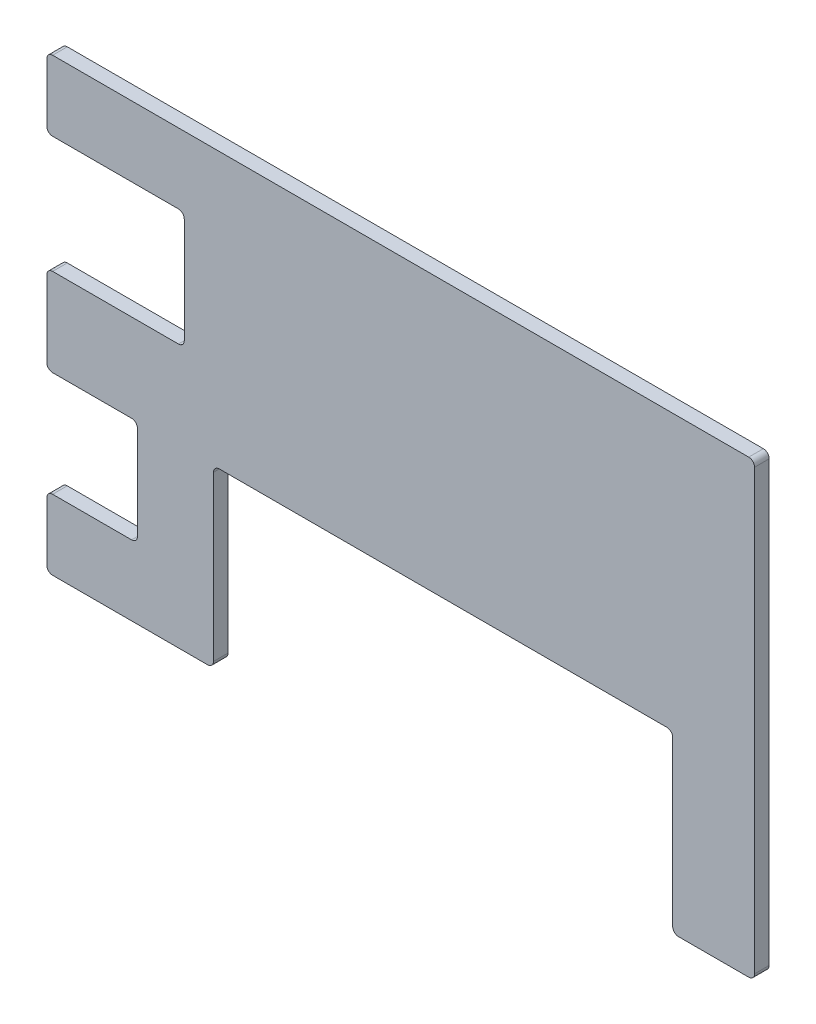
ISO-10303-21;
HEADER;
FILE_DESCRIPTION(('STEP AP214'),'2;1');
FILE_NAME('part.step','',(''),(''),'','','');
FILE_SCHEMA(('AUTOMOTIVE_DESIGN { 1 0 10303 214 1 1 1 1 }'));
ENDSEC;
DATA;
#1=APPLICATION_CONTEXT('core data for automotive mechanical design processes');
#2=APPLICATION_PROTOCOL_DEFINITION('international standard','automotive_design',2000,#1);
#3=PRODUCT_CONTEXT('',#1,'mechanical');
#4=PRODUCT('Part','Part','',(#3));
#5=PRODUCT_RELATED_PRODUCT_CATEGORY('part','',(#4));
#6=PRODUCT_DEFINITION_FORMATION('','',#4);
#7=PRODUCT_DEFINITION_CONTEXT('part definition',#1,'design');
#8=PRODUCT_DEFINITION('design','',#6,#7);
#9=PRODUCT_DEFINITION_SHAPE('','',#8);
#10=(LENGTH_UNIT() NAMED_UNIT(*) SI_UNIT(.MILLI.,.METRE.));
#11=(NAMED_UNIT(*) PLANE_ANGLE_UNIT() SI_UNIT($,.RADIAN.));
#12=(NAMED_UNIT(*) SI_UNIT($,.STERADIAN.) SOLID_ANGLE_UNIT());
#13=UNCERTAINTY_MEASURE_WITH_UNIT(LENGTH_MEASURE(1.E-05),#10,'distance_accuracy_value','');
#14=(GEOMETRIC_REPRESENTATION_CONTEXT(3) GLOBAL_UNCERTAINTY_ASSIGNED_CONTEXT((#13)) GLOBAL_UNIT_ASSIGNED_CONTEXT((#10,
#11,#12)) REPRESENTATION_CONTEXT('',''));
#15=CARTESIAN_POINT('',(0.,0.,0.));
#16=DIRECTION('',(0.,0.,1.));
#17=DIRECTION('',(1.,0.,0.));
#18=AXIS2_PLACEMENT_3D('',#15,#16,#17);
#19=CARTESIAN_POINT('',(59.5000007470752,37.0000007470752,2.5));
#20=DIRECTION('',(0.,0.,-1.));
#21=DIRECTION('',(-1.,0.,0.));
#22=AXIS2_PLACEMENT_3D('',#19,#20,#21);
#23=CYLINDRICAL_SURFACE('',#22,0.999999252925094);
#24=CARTESIAN_POINT('',(59.5000007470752,37.0000007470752,0.));
#25=DIRECTION('',(0.,0.,1.));
#26=DIRECTION('',(1.,0.,0.));
#27=AXIS2_PLACEMENT_3D('',#24,#25,#26);
#28=CIRCLE('',#27,0.999999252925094);
#29=CARTESIAN_POINT('',(60.5,37.,0.));
#30=VERTEX_POINT('',#29);
#31=CARTESIAN_POINT('',(59.5,38.,0.));
#32=VERTEX_POINT('',#31);
#33=EDGE_CURVE('E273',#30,#32,#28,.T.);
#34=ORIENTED_EDGE('',*,*,#33,.T.);
#35=DIRECTION('',(0.,0.,-1.));
#36=VECTOR('',#35,1.);
#37=CARTESIAN_POINT('',(59.5,38.,2.5));
#38=LINE('',#37,#36);
#39=CARTESIAN_POINT('',(59.5,38.,2.5));
#40=VERTEX_POINT('',#39);
#41=EDGE_CURVE('E11',#40,#32,#38,.T.);
#42=ORIENTED_EDGE('',*,*,#41,.F.);
#43=CARTESIAN_POINT('',(59.5000007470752,37.0000007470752,2.5));
#44=DIRECTION('',(0.,0.,1.));
#45=DIRECTION('',(1.,0.,0.));
#46=AXIS2_PLACEMENT_3D('',#43,#44,#45);
#47=CIRCLE('',#46,0.999999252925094);
#48=CARTESIAN_POINT('',(60.5,37.,2.5));
#49=VERTEX_POINT('',#48);
#50=EDGE_CURVE('E347',#49,#40,#47,.T.);
#51=ORIENTED_EDGE('',*,*,#50,.F.);
#52=DIRECTION('',(0.,0.,-1.));
#53=VECTOR('',#52,1.);
#54=CARTESIAN_POINT('',(60.5,37.,2.5));
#55=LINE('',#54,#53);
#56=EDGE_CURVE('E269',#49,#30,#55,.T.);
#57=ORIENTED_EDGE('',*,*,#56,.T.);
#58=EDGE_LOOP('',(#34,#42,#51,#57));
#59=FACE_BOUND('',#58,.T.);
#60=ADVANCED_FACE('F33',(#59),#23,.T.);
#61=CARTESIAN_POINT('',(59.5,38.,2.5));
#62=DIRECTION('',(0.,-1.,0.));
#63=DIRECTION('',(0.,0.,-1.));
#64=AXIS2_PLACEMENT_3D('',#61,#62,#63);
#65=PLANE('',#64);
#66=DIRECTION('',(-1.,0.,0.));
#67=VECTOR('',#66,1.);
#68=CARTESIAN_POINT('',(59.5,38.,0.));
#69=LINE('',#68,#67);
#70=CARTESIAN_POINT('',(-59.5,38.,0.));
#71=VERTEX_POINT('',#70);
#72=EDGE_CURVE('E276',#32,#71,#69,.T.);
#73=ORIENTED_EDGE('',*,*,#72,.T.);
#74=DIRECTION('',(0.,0.,-1.));
#75=VECTOR('',#74,1.);
#76=CARTESIAN_POINT('',(-59.5,38.,2.5));
#77=LINE('',#76,#75);
#78=CARTESIAN_POINT('',(-59.5,38.,2.5));
#79=VERTEX_POINT('',#78);
#80=EDGE_CURVE('E41',#79,#71,#77,.T.);
#81=ORIENTED_EDGE('',*,*,#80,.F.);
#82=DIRECTION('',(-1.,0.,0.));
#83=VECTOR('',#82,1.);
#84=CARTESIAN_POINT('',(59.5,38.,2.5));
#85=LINE('',#84,#83);
#86=EDGE_CURVE('E164',#40,#79,#85,.T.);
#87=ORIENTED_EDGE('',*,*,#86,.F.);
#88=ORIENTED_EDGE('',*,*,#41,.T.);
#89=EDGE_LOOP('',(#73,#81,#87,#88));
#90=FACE_BOUND('',#89,.T.);
#91=ADVANCED_FACE('F518',(#90),#65,.F.);
#92=CARTESIAN_POINT('',(-59.5000007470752,37.0000007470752,2.5));
#93=DIRECTION('',(0.,0.,-1.));
#94=DIRECTION('',(-1.,0.,0.));
#95=AXIS2_PLACEMENT_3D('',#92,#93,#94);
#96=CYLINDRICAL_SURFACE('',#95,0.999999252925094);
#97=CARTESIAN_POINT('',(-59.5000007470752,37.0000007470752,0.));
#98=DIRECTION('',(0.,0.,1.));
#99=DIRECTION('',(1.,0.,0.));
#100=AXIS2_PLACEMENT_3D('',#97,#98,#99);
#101=CIRCLE('',#100,0.999999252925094);
#102=CARTESIAN_POINT('',(-60.5,37.,0.));
#103=VERTEX_POINT('',#102);
#104=EDGE_CURVE('E278',#71,#103,#101,.T.);
#105=ORIENTED_EDGE('',*,*,#104,.T.);
#106=DIRECTION('',(0.,0.,-1.));
#107=VECTOR('',#106,1.);
#108=CARTESIAN_POINT('',(-60.5,37.,2.5));
#109=LINE('',#108,#107);
#110=CARTESIAN_POINT('',(-60.5,37.,2.5));
#111=VERTEX_POINT('',#110);
#112=EDGE_CURVE('E414',#111,#103,#109,.T.);
#113=ORIENTED_EDGE('',*,*,#112,.F.);
#114=CARTESIAN_POINT('',(-59.5000007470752,37.0000007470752,2.5));
#115=DIRECTION('',(0.,0.,1.));
#116=DIRECTION('',(1.,0.,0.));
#117=AXIS2_PLACEMENT_3D('',#114,#115,#116);
#118=CIRCLE('',#117,0.999999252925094);
#119=EDGE_CURVE('E422',#79,#111,#118,.T.);
#120=ORIENTED_EDGE('',*,*,#119,.F.);
#121=ORIENTED_EDGE('',*,*,#80,.T.);
#122=EDGE_LOOP('',(#105,#113,#120,#121));
#123=FACE_BOUND('',#122,.T.);
#124=ADVANCED_FACE('F420',(#123),#96,.T.);
#125=CARTESIAN_POINT('',(-60.5,37.,2.5));
#126=DIRECTION('',(1.,0.,0.));
#127=DIRECTION('',(0.,0.,-1.));
#128=AXIS2_PLACEMENT_3D('',#125,#126,#127);
#129=PLANE('',#128);
#130=DIRECTION('',(0.,-1.,0.));
#131=VECTOR('',#130,1.);
#132=CARTESIAN_POINT('',(-60.5,37.,0.));
#133=LINE('',#132,#131);
#134=CARTESIAN_POINT('',(-60.5,27.,0.));
#135=VERTEX_POINT('',#134);
#136=EDGE_CURVE('E280',#103,#135,#133,.T.);
#137=ORIENTED_EDGE('',*,*,#136,.T.);
#138=DIRECTION('',(0.,0.,-1.));
#139=VECTOR('',#138,1.);
#140=CARTESIAN_POINT('',(-60.5,27.,2.5));
#141=LINE('',#140,#139);
#142=CARTESIAN_POINT('',(-60.5,27.,2.5));
#143=VERTEX_POINT('',#142);
#144=EDGE_CURVE('E411',#143,#135,#141,.T.);
#145=ORIENTED_EDGE('',*,*,#144,.F.);
#146=DIRECTION('',(0.,-1.,0.));
#147=VECTOR('',#146,1.);
#148=CARTESIAN_POINT('',(-60.5,37.,2.5));
#149=LINE('',#148,#147);
#150=EDGE_CURVE('E440',#111,#143,#149,.T.);
#151=ORIENTED_EDGE('',*,*,#150,.F.);
#152=ORIENTED_EDGE('',*,*,#112,.T.);
#153=EDGE_LOOP('',(#137,#145,#151,#152));
#154=FACE_BOUND('',#153,.T.);
#155=ADVANCED_FACE('F431',(#154),#129,.F.);
#156=CARTESIAN_POINT('',(-59.5000007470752,26.9999992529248,2.5));
#157=DIRECTION('',(0.,0.,-1.));
#158=DIRECTION('',(-1.,0.,0.));
#159=AXIS2_PLACEMENT_3D('',#156,#157,#158);
#160=CYLINDRICAL_SURFACE('',#159,0.999999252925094);
#161=CARTESIAN_POINT('',(-59.5000007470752,26.9999992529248,0.));
#162=DIRECTION('',(0.,0.,1.));
#163=DIRECTION('',(1.,0.,0.));
#164=AXIS2_PLACEMENT_3D('',#161,#162,#163);
#165=CIRCLE('',#164,0.999999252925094);
#166=CARTESIAN_POINT('',(-59.5,26.,0.));
#167=VERTEX_POINT('',#166);
#168=EDGE_CURVE('E282',#135,#167,#165,.T.);
#169=ORIENTED_EDGE('',*,*,#168,.T.);
#170=DIRECTION('',(0.,0.,-1.));
#171=VECTOR('',#170,1.);
#172=CARTESIAN_POINT('',(-59.5,26.,2.5));
#173=LINE('',#172,#171);
#174=CARTESIAN_POINT('',(-59.5,26.,2.5));
#175=VERTEX_POINT('',#174);
#176=EDGE_CURVE('E408',#175,#167,#173,.T.);
#177=ORIENTED_EDGE('',*,*,#176,.F.);
#178=CARTESIAN_POINT('',(-59.5000007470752,26.9999992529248,2.5));
#179=DIRECTION('',(0.,0.,1.));
#180=DIRECTION('',(1.,0.,0.));
#181=AXIS2_PLACEMENT_3D('',#178,#179,#180);
#182=CIRCLE('',#181,0.999999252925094);
#183=EDGE_CURVE('E437',#143,#175,#182,.T.);
#184=ORIENTED_EDGE('',*,*,#183,.F.);
#185=ORIENTED_EDGE('',*,*,#144,.T.);
#186=EDGE_LOOP('',(#169,#177,#184,#185));
#187=FACE_BOUND('',#186,.T.);
#188=ADVANCED_FACE('F435',(#187),#160,.T.);
#189=CARTESIAN_POINT('',(-59.5,26.,2.5));
#190=DIRECTION('',(0.,1.,0.));
#191=DIRECTION('',(0.,0.,1.));
#192=AXIS2_PLACEMENT_3D('',#189,#190,#191);
#193=PLANE('',#192);
#194=DIRECTION('',(1.,0.,0.));
#195=VECTOR('',#194,1.);
#196=CARTESIAN_POINT('',(-59.5,26.,0.));
#197=LINE('',#196,#195);
#198=CARTESIAN_POINT('',(-38.,26.,0.));
#199=VERTEX_POINT('',#198);
#200=EDGE_CURVE('E284',#167,#199,#197,.T.);
#201=ORIENTED_EDGE('',*,*,#200,.T.);
#202=DIRECTION('',(0.,0.,-1.));
#203=VECTOR('',#202,1.);
#204=CARTESIAN_POINT('',(-38.,26.,2.5));
#205=LINE('',#204,#203);
#206=CARTESIAN_POINT('',(-38.,26.,2.5));
#207=VERTEX_POINT('',#206);
#208=EDGE_CURVE('E406',#207,#199,#205,.T.);
#209=ORIENTED_EDGE('',*,*,#208,.F.);
#210=DIRECTION('',(1.,0.,0.));
#211=VECTOR('',#210,1.);
#212=CARTESIAN_POINT('',(-59.5,26.,2.5));
#213=LINE('',#212,#211);
#214=EDGE_CURVE('E439',#175,#207,#213,.T.);
#215=ORIENTED_EDGE('',*,*,#214,.F.);
#216=ORIENTED_EDGE('',*,*,#176,.T.);
#217=EDGE_LOOP('',(#201,#209,#215,#216));
#218=FACE_BOUND('',#217,.T.);
#219=ADVANCED_FACE('F531',(#218),#193,.F.);
#220=CARTESIAN_POINT('',(-37.9999992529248,25.0000007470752,2.5));
#221=DIRECTION('',(0.,0.,-1.));
#222=DIRECTION('',(-1.,0.,0.));
#223=AXIS2_PLACEMENT_3D('',#220,#221,#222);
#224=CYLINDRICAL_SURFACE('',#223,0.999999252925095);
#225=CARTESIAN_POINT('',(-37.9999992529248,25.0000007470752,0.));
#226=DIRECTION('',(0.,0.,1.));
#227=DIRECTION('',(1.,0.,0.));
#228=AXIS2_PLACEMENT_3D('',#225,#226,#227);
#229=CIRCLE('',#228,0.999999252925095);
#230=CARTESIAN_POINT('',(-37.,25.,0.));
#231=VERTEX_POINT('',#230);
#232=EDGE_CURVE('E287',#231,#199,#229,.T.);
#233=ORIENTED_EDGE('',*,*,#232,.F.);
#234=DIRECTION('',(0.,0.,-1.));
#235=VECTOR('',#234,1.);
#236=CARTESIAN_POINT('',(-37.,25.,2.5));
#237=LINE('',#236,#235);
#238=CARTESIAN_POINT('',(-37.,25.,2.5));
#239=VERTEX_POINT('',#238);
#240=EDGE_CURVE('E404',#239,#231,#237,.T.);
#241=ORIENTED_EDGE('',*,*,#240,.F.);
#242=CARTESIAN_POINT('',(-37.9999992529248,25.0000007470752,2.5));
#243=DIRECTION('',(0.,0.,1.));
#244=DIRECTION('',(1.,0.,0.));
#245=AXIS2_PLACEMENT_3D('',#242,#243,#244);
#246=CIRCLE('',#245,0.999999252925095);
#247=EDGE_CURVE('E442',#239,#207,#246,.T.);
#248=ORIENTED_EDGE('',*,*,#247,.T.);
#249=ORIENTED_EDGE('',*,*,#208,.T.);
#250=EDGE_LOOP('',(#233,#241,#248,#249));
#251=FACE_BOUND('',#250,.T.);
#252=ADVANCED_FACE('F534',(#251),#224,.F.);
#253=CARTESIAN_POINT('',(-37.,25.,2.5));
#254=DIRECTION('',(1.,0.,0.));
#255=DIRECTION('',(0.,0.,-1.));
#256=AXIS2_PLACEMENT_3D('',#253,#254,#255);
#257=PLANE('',#256);
#258=DIRECTION('',(0.,-1.,0.));
#259=VECTOR('',#258,1.);
#260=CARTESIAN_POINT('',(-37.,25.,0.));
#261=LINE('',#260,#259);
#262=CARTESIAN_POINT('',(-37.,7.,0.));
#263=VERTEX_POINT('',#262);
#264=EDGE_CURVE('E290',#231,#263,#261,.T.);
#265=ORIENTED_EDGE('',*,*,#264,.T.);
#266=DIRECTION('',(0.,0.,-1.));
#267=VECTOR('',#266,1.);
#268=CARTESIAN_POINT('',(-37.,7.,2.5));
#269=LINE('',#268,#267);
#270=CARTESIAN_POINT('',(-37.,7.,2.5));
#271=VERTEX_POINT('',#270);
#272=EDGE_CURVE('E402',#271,#263,#269,.T.);
#273=ORIENTED_EDGE('',*,*,#272,.F.);
#274=DIRECTION('',(0.,-1.,0.));
#275=VECTOR('',#274,1.);
#276=CARTESIAN_POINT('',(-37.,25.,2.5));
#277=LINE('',#276,#275);
#278=EDGE_CURVE('E449',#239,#271,#277,.T.);
#279=ORIENTED_EDGE('',*,*,#278,.F.);
#280=ORIENTED_EDGE('',*,*,#240,.T.);
#281=EDGE_LOOP('',(#265,#273,#279,#280));
#282=FACE_BOUND('',#281,.T.);
#283=ADVANCED_FACE('F538',(#282),#257,.F.);
#284=CARTESIAN_POINT('',(-37.9999992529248,6.99999925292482,2.5));
#285=DIRECTION('',(0.,0.,-1.));
#286=DIRECTION('',(-1.,0.,0.));
#287=AXIS2_PLACEMENT_3D('',#284,#285,#286);
#288=CYLINDRICAL_SURFACE('',#287,0.999999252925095);
#289=CARTESIAN_POINT('',(-37.9999992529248,6.99999925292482,0.));
#290=DIRECTION('',(0.,0.,1.));
#291=DIRECTION('',(1.,0.,0.));
#292=AXIS2_PLACEMENT_3D('',#289,#290,#291);
#293=CIRCLE('',#292,0.999999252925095);
#294=CARTESIAN_POINT('',(-38.,6.,0.));
#295=VERTEX_POINT('',#294);
#296=EDGE_CURVE('E293',#295,#263,#293,.T.);
#297=ORIENTED_EDGE('',*,*,#296,.F.);
#298=DIRECTION('',(0.,0.,-1.));
#299=VECTOR('',#298,1.);
#300=CARTESIAN_POINT('',(-38.,6.,2.5));
#301=LINE('',#300,#299);
#302=CARTESIAN_POINT('',(-38.,6.,2.5));
#303=VERTEX_POINT('',#302);
#304=EDGE_CURVE('E400',#303,#295,#301,.T.);
#305=ORIENTED_EDGE('',*,*,#304,.F.);
#306=CARTESIAN_POINT('',(-37.9999992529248,6.99999925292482,2.5));
#307=DIRECTION('',(0.,0.,1.));
#308=DIRECTION('',(1.,0.,0.));
#309=AXIS2_PLACEMENT_3D('',#306,#307,#308);
#310=CIRCLE('',#309,0.999999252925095);
#311=EDGE_CURVE('E451',#303,#271,#310,.T.);
#312=ORIENTED_EDGE('',*,*,#311,.T.);
#313=ORIENTED_EDGE('',*,*,#272,.T.);
#314=EDGE_LOOP('',(#297,#305,#312,#313));
#315=FACE_BOUND('',#314,.T.);
#316=ADVANCED_FACE('F542',(#315),#288,.F.);
#317=CARTESIAN_POINT('',(-38.,6.,2.5));
#318=DIRECTION('',(0.,-1.,0.));
#319=DIRECTION('',(0.,0.,-1.));
#320=AXIS2_PLACEMENT_3D('',#317,#318,#319);
#321=PLANE('',#320);
#322=DIRECTION('',(-1.,0.,0.));
#323=VECTOR('',#322,1.);
#324=CARTESIAN_POINT('',(-38.,6.,0.));
#325=LINE('',#324,#323);
#326=CARTESIAN_POINT('',(-59.5,6.,0.));
#327=VERTEX_POINT('',#326);
#328=EDGE_CURVE('E296',#295,#327,#325,.T.);
#329=ORIENTED_EDGE('',*,*,#328,.T.);
#330=DIRECTION('',(0.,0.,-1.));
#331=VECTOR('',#330,1.);
#332=CARTESIAN_POINT('',(-59.5,6.,2.5));
#333=LINE('',#332,#331);
#334=CARTESIAN_POINT('',(-59.5,6.,2.5));
#335=VERTEX_POINT('',#334);
#336=EDGE_CURVE('E397',#335,#327,#333,.T.);
#337=ORIENTED_EDGE('',*,*,#336,.F.);
#338=DIRECTION('',(-1.,0.,0.));
#339=VECTOR('',#338,1.);
#340=CARTESIAN_POINT('',(-38.,6.,2.5));
#341=LINE('',#340,#339);
#342=EDGE_CURVE('E454',#303,#335,#341,.T.);
#343=ORIENTED_EDGE('',*,*,#342,.F.);
#344=ORIENTED_EDGE('',*,*,#304,.T.);
#345=EDGE_LOOP('',(#329,#337,#343,#344));
#346=FACE_BOUND('',#345,.T.);
#347=ADVANCED_FACE('F546',(#346),#321,.F.);
#348=CARTESIAN_POINT('',(-59.5000007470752,5.00000074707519,2.5));
#349=DIRECTION('',(0.,0.,-1.));
#350=DIRECTION('',(-1.,0.,0.));
#351=AXIS2_PLACEMENT_3D('',#348,#349,#350);
#352=CYLINDRICAL_SURFACE('',#351,0.999999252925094);
#353=CARTESIAN_POINT('',(-59.5000007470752,5.00000074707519,0.));
#354=DIRECTION('',(0.,0.,1.));
#355=DIRECTION('',(1.,0.,0.));
#356=AXIS2_PLACEMENT_3D('',#353,#354,#355);
#357=CIRCLE('',#356,0.999999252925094);
#358=CARTESIAN_POINT('',(-60.5,5.,0.));
#359=VERTEX_POINT('',#358);
#360=EDGE_CURVE('E298',#327,#359,#357,.T.);
#361=ORIENTED_EDGE('',*,*,#360,.T.);
#362=DIRECTION('',(0.,0.,-1.));
#363=VECTOR('',#362,1.);
#364=CARTESIAN_POINT('',(-60.5,5.,2.5));
#365=LINE('',#364,#363);
#366=CARTESIAN_POINT('',(-60.5,5.,2.5));
#367=VERTEX_POINT('',#366);
#368=EDGE_CURVE('E394',#367,#359,#365,.T.);
#369=ORIENTED_EDGE('',*,*,#368,.F.);
#370=CARTESIAN_POINT('',(-59.5000007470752,5.00000074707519,2.5));
#371=DIRECTION('',(0.,0.,1.));
#372=DIRECTION('',(1.,0.,0.));
#373=AXIS2_PLACEMENT_3D('',#370,#371,#372);
#374=CIRCLE('',#373,0.999999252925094);
#375=EDGE_CURVE('E456',#335,#367,#374,.T.);
#376=ORIENTED_EDGE('',*,*,#375,.F.);
#377=ORIENTED_EDGE('',*,*,#336,.T.);
#378=EDGE_LOOP('',(#361,#369,#376,#377));
#379=FACE_BOUND('',#378,.T.);
#380=ADVANCED_FACE('F550',(#379),#352,.T.);
#381=CARTESIAN_POINT('',(-60.5,5.,2.5));
#382=DIRECTION('',(1.,0.,0.));
#383=DIRECTION('',(0.,0.,-1.));
#384=AXIS2_PLACEMENT_3D('',#381,#382,#383);
#385=PLANE('',#384);
#386=DIRECTION('',(0.,-1.,0.));
#387=VECTOR('',#386,1.);
#388=CARTESIAN_POINT('',(-60.5,5.,0.));
#389=LINE('',#388,#387);
#390=CARTESIAN_POINT('',(-60.5,-8.,0.));
#391=VERTEX_POINT('',#390);
#392=EDGE_CURVE('E300',#359,#391,#389,.T.);
#393=ORIENTED_EDGE('',*,*,#392,.T.);
#394=DIRECTION('',(0.,0.,-1.));
#395=VECTOR('',#394,1.);
#396=CARTESIAN_POINT('',(-60.5,-8.,2.5));
#397=LINE('',#396,#395);
#398=CARTESIAN_POINT('',(-60.5,-8.,2.5));
#399=VERTEX_POINT('',#398);
#400=EDGE_CURVE('E391',#399,#391,#397,.T.);
#401=ORIENTED_EDGE('',*,*,#400,.F.);
#402=DIRECTION('',(0.,-1.,0.));
#403=VECTOR('',#402,1.);
#404=CARTESIAN_POINT('',(-60.5,5.,2.5));
#405=LINE('',#404,#403);
#406=EDGE_CURVE('E458',#367,#399,#405,.T.);
#407=ORIENTED_EDGE('',*,*,#406,.F.);
#408=ORIENTED_EDGE('',*,*,#368,.T.);
#409=EDGE_LOOP('',(#393,#401,#407,#408));
#410=FACE_BOUND('',#409,.T.);
#411=ADVANCED_FACE('F554',(#410),#385,.F.);
#412=CARTESIAN_POINT('',(-59.5000007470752,-8.00000074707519,2.5));
#413=DIRECTION('',(0.,0.,-1.));
#414=DIRECTION('',(-1.,0.,0.));
#415=AXIS2_PLACEMENT_3D('',#412,#413,#414);
#416=CYLINDRICAL_SURFACE('',#415,0.999999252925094);
#417=CARTESIAN_POINT('',(-59.5000007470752,-8.00000074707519,0.));
#418=DIRECTION('',(0.,0.,1.));
#419=DIRECTION('',(1.,0.,0.));
#420=AXIS2_PLACEMENT_3D('',#417,#418,#419);
#421=CIRCLE('',#420,0.999999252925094);
#422=CARTESIAN_POINT('',(-59.5,-9.,0.));
#423=VERTEX_POINT('',#422);
#424=EDGE_CURVE('E302',#391,#423,#421,.T.);
#425=ORIENTED_EDGE('',*,*,#424,.T.);
#426=DIRECTION('',(0.,0.,-1.));
#427=VECTOR('',#426,1.);
#428=CARTESIAN_POINT('',(-59.5,-9.,2.5));
#429=LINE('',#428,#427);
#430=CARTESIAN_POINT('',(-59.5,-9.,2.5));
#431=VERTEX_POINT('',#430);
#432=EDGE_CURVE('E388',#431,#423,#429,.T.);
#433=ORIENTED_EDGE('',*,*,#432,.F.);
#434=CARTESIAN_POINT('',(-59.5000007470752,-8.00000074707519,2.5));
#435=DIRECTION('',(0.,0.,1.));
#436=DIRECTION('',(1.,0.,0.));
#437=AXIS2_PLACEMENT_3D('',#434,#435,#436);
#438=CIRCLE('',#437,0.999999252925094);
#439=EDGE_CURVE('E460',#399,#431,#438,.T.);
#440=ORIENTED_EDGE('',*,*,#439,.F.);
#441=ORIENTED_EDGE('',*,*,#400,.T.);
#442=EDGE_LOOP('',(#425,#433,#440,#441));
#443=FACE_BOUND('',#442,.T.);
#444=ADVANCED_FACE('F558',(#443),#416,.T.);
#445=CARTESIAN_POINT('',(-59.5,-9.,2.5));
#446=DIRECTION('',(0.,1.,0.));
#447=DIRECTION('',(0.,0.,1.));
#448=AXIS2_PLACEMENT_3D('',#445,#446,#447);
#449=PLANE('',#448);
#450=DIRECTION('',(1.,0.,0.));
#451=VECTOR('',#450,1.);
#452=CARTESIAN_POINT('',(-59.5,-9.,0.));
#453=LINE('',#452,#451);
#454=CARTESIAN_POINT('',(-46.,-9.,0.));
#455=VERTEX_POINT('',#454);
#456=EDGE_CURVE('E304',#423,#455,#453,.T.);
#457=ORIENTED_EDGE('',*,*,#456,.T.);
#458=DIRECTION('',(0.,0.,-1.));
#459=VECTOR('',#458,1.);
#460=CARTESIAN_POINT('',(-46.,-9.,2.5));
#461=LINE('',#460,#459);
#462=CARTESIAN_POINT('',(-46.,-9.,2.5));
#463=VERTEX_POINT('',#462);
#464=EDGE_CURVE('E386',#463,#455,#461,.T.);
#465=ORIENTED_EDGE('',*,*,#464,.F.);
#466=DIRECTION('',(1.,0.,0.));
#467=VECTOR('',#466,1.);
#468=CARTESIAN_POINT('',(-59.5,-9.,2.5));
#469=LINE('',#468,#467);
#470=EDGE_CURVE('E462',#431,#463,#469,.T.);
#471=ORIENTED_EDGE('',*,*,#470,.F.);
#472=ORIENTED_EDGE('',*,*,#432,.T.);
#473=EDGE_LOOP('',(#457,#465,#471,#472));
#474=FACE_BOUND('',#473,.T.);
#475=ADVANCED_FACE('F562',(#474),#449,.F.);
#476=CARTESIAN_POINT('',(-45.9999992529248,-9.99999925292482,2.5));
#477=DIRECTION('',(0.,0.,-1.));
#478=DIRECTION('',(-1.,0.,0.));
#479=AXIS2_PLACEMENT_3D('',#476,#477,#478);
#480=CYLINDRICAL_SURFACE('',#479,0.999999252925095);
#481=CARTESIAN_POINT('',(-45.9999992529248,-9.99999925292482,0.));
#482=DIRECTION('',(0.,0.,1.));
#483=DIRECTION('',(1.,0.,0.));
#484=AXIS2_PLACEMENT_3D('',#481,#482,#483);
#485=CIRCLE('',#484,0.999999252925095);
#486=CARTESIAN_POINT('',(-45.,-10.,0.));
#487=VERTEX_POINT('',#486);
#488=EDGE_CURVE('E307',#487,#455,#485,.T.);
#489=ORIENTED_EDGE('',*,*,#488,.F.);
#490=DIRECTION('',(0.,0.,-1.));
#491=VECTOR('',#490,1.);
#492=CARTESIAN_POINT('',(-45.,-10.,2.5));
#493=LINE('',#492,#491);
#494=CARTESIAN_POINT('',(-45.,-10.,2.5));
#495=VERTEX_POINT('',#494);
#496=EDGE_CURVE('E384',#495,#487,#493,.T.);
#497=ORIENTED_EDGE('',*,*,#496,.F.);
#498=CARTESIAN_POINT('',(-45.9999992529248,-9.99999925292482,2.5));
#499=DIRECTION('',(0.,0.,1.));
#500=DIRECTION('',(1.,0.,0.));
#501=AXIS2_PLACEMENT_3D('',#498,#499,#500);
#502=CIRCLE('',#501,0.999999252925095);
#503=EDGE_CURVE('E464',#495,#463,#502,.T.);
#504=ORIENTED_EDGE('',*,*,#503,.T.);
#505=ORIENTED_EDGE('',*,*,#464,.T.);
#506=EDGE_LOOP('',(#489,#497,#504,#505));
#507=FACE_BOUND('',#506,.T.);
#508=ADVANCED_FACE('F566',(#507),#480,.F.);
#509=CARTESIAN_POINT('',(-45.,-10.,2.5));
#510=DIRECTION('',(1.,0.,0.));
#511=DIRECTION('',(0.,0.,-1.));
#512=AXIS2_PLACEMENT_3D('',#509,#510,#511);
#513=PLANE('',#512);
#514=DIRECTION('',(0.,-1.,0.));
#515=VECTOR('',#514,1.);
#516=CARTESIAN_POINT('',(-45.,-10.,0.));
#517=LINE('',#516,#515);
#518=CARTESIAN_POINT('',(-45.,-26.,0.));
#519=VERTEX_POINT('',#518);
#520=EDGE_CURVE('E310',#487,#519,#517,.T.);
#521=ORIENTED_EDGE('',*,*,#520,.T.);
#522=DIRECTION('',(0.,0.,-1.));
#523=VECTOR('',#522,1.);
#524=CARTESIAN_POINT('',(-45.,-26.,2.5));
#525=LINE('',#524,#523);
#526=CARTESIAN_POINT('',(-45.,-26.,2.5));
#527=VERTEX_POINT('',#526);
#528=EDGE_CURVE('E382',#527,#519,#525,.T.);
#529=ORIENTED_EDGE('',*,*,#528,.F.);
#530=DIRECTION('',(0.,-1.,0.));
#531=VECTOR('',#530,1.);
#532=CARTESIAN_POINT('',(-45.,-10.,2.5));
#533=LINE('',#532,#531);
#534=EDGE_CURVE('E467',#495,#527,#533,.T.);
#535=ORIENTED_EDGE('',*,*,#534,.F.);
#536=ORIENTED_EDGE('',*,*,#496,.T.);
#537=EDGE_LOOP('',(#521,#529,#535,#536));
#538=FACE_BOUND('',#537,.T.);
#539=ADVANCED_FACE('F570',(#538),#513,.F.);
#540=CARTESIAN_POINT('',(-45.9999992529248,-26.0000007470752,2.5));
#541=DIRECTION('',(0.,0.,-1.));
#542=DIRECTION('',(-1.,0.,0.));
#543=AXIS2_PLACEMENT_3D('',#540,#541,#542);
#544=CYLINDRICAL_SURFACE('',#543,0.999999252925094);
#545=CARTESIAN_POINT('',(-45.9999992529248,-26.0000007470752,0.));
#546=DIRECTION('',(0.,0.,1.));
#547=DIRECTION('',(1.,0.,0.));
#548=AXIS2_PLACEMENT_3D('',#545,#546,#547);
#549=CIRCLE('',#548,0.999999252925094);
#550=CARTESIAN_POINT('',(-46.,-27.,0.));
#551=VERTEX_POINT('',#550);
#552=EDGE_CURVE('E313',#551,#519,#549,.T.);
#553=ORIENTED_EDGE('',*,*,#552,.F.);
#554=DIRECTION('',(0.,0.,-1.));
#555=VECTOR('',#554,1.);
#556=CARTESIAN_POINT('',(-46.,-27.,2.5));
#557=LINE('',#556,#555);
#558=CARTESIAN_POINT('',(-46.,-27.,2.5));
#559=VERTEX_POINT('',#558);
#560=EDGE_CURVE('E380',#559,#551,#557,.T.);
#561=ORIENTED_EDGE('',*,*,#560,.F.);
#562=CARTESIAN_POINT('',(-45.9999992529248,-26.0000007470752,2.5));
#563=DIRECTION('',(0.,0.,1.));
#564=DIRECTION('',(1.,0.,0.));
#565=AXIS2_PLACEMENT_3D('',#562,#563,#564);
#566=CIRCLE('',#565,0.999999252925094);
#567=EDGE_CURVE('E469',#559,#527,#566,.T.);
#568=ORIENTED_EDGE('',*,*,#567,.T.);
#569=ORIENTED_EDGE('',*,*,#528,.T.);
#570=EDGE_LOOP('',(#553,#561,#568,#569));
#571=FACE_BOUND('',#570,.T.);
#572=ADVANCED_FACE('F574',(#571),#544,.F.);
#573=CARTESIAN_POINT('',(-46.,-27.,2.5));
#574=DIRECTION('',(0.,-1.,0.));
#575=DIRECTION('',(0.,0.,-1.));
#576=AXIS2_PLACEMENT_3D('',#573,#574,#575);
#577=PLANE('',#576);
#578=DIRECTION('',(-1.,0.,0.));
#579=VECTOR('',#578,1.);
#580=CARTESIAN_POINT('',(-46.,-27.,0.));
#581=LINE('',#580,#579);
#582=CARTESIAN_POINT('',(-59.5,-27.,0.));
#583=VERTEX_POINT('',#582);
#584=EDGE_CURVE('E316',#551,#583,#581,.T.);
#585=ORIENTED_EDGE('',*,*,#584,.T.);
#586=DIRECTION('',(0.,0.,-1.));
#587=VECTOR('',#586,1.);
#588=CARTESIAN_POINT('',(-59.5,-27.,2.5));
#589=LINE('',#588,#587);
#590=CARTESIAN_POINT('',(-59.5,-27.,2.5));
#591=VERTEX_POINT('',#590);
#592=EDGE_CURVE('E377',#591,#583,#589,.T.);
#593=ORIENTED_EDGE('',*,*,#592,.F.);
#594=DIRECTION('',(-1.,0.,0.));
#595=VECTOR('',#594,1.);
#596=CARTESIAN_POINT('',(-46.,-27.,2.5));
#597=LINE('',#596,#595);
#598=EDGE_CURVE('E472',#559,#591,#597,.T.);
#599=ORIENTED_EDGE('',*,*,#598,.F.);
#600=ORIENTED_EDGE('',*,*,#560,.T.);
#601=EDGE_LOOP('',(#585,#593,#599,#600));
#602=FACE_BOUND('',#601,.T.);
#603=ADVANCED_FACE('F578',(#602),#577,.F.);
#604=CARTESIAN_POINT('',(-59.5000007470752,-27.9999992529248,2.5));
#605=DIRECTION('',(0.,0.,-1.));
#606=DIRECTION('',(-1.,0.,0.));
#607=AXIS2_PLACEMENT_3D('',#604,#605,#606);
#608=CYLINDRICAL_SURFACE('',#607,0.999999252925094);
#609=CARTESIAN_POINT('',(-59.5000007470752,-27.9999992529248,0.));
#610=DIRECTION('',(0.,0.,1.));
#611=DIRECTION('',(1.,0.,0.));
#612=AXIS2_PLACEMENT_3D('',#609,#610,#611);
#613=CIRCLE('',#612,0.999999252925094);
#614=CARTESIAN_POINT('',(-60.5,-28.,0.));
#615=VERTEX_POINT('',#614);
#616=EDGE_CURVE('E318',#583,#615,#613,.T.);
#617=ORIENTED_EDGE('',*,*,#616,.T.);
#618=DIRECTION('',(0.,0.,-1.));
#619=VECTOR('',#618,1.);
#620=CARTESIAN_POINT('',(-60.5,-28.,2.5));
#621=LINE('',#620,#619);
#622=CARTESIAN_POINT('',(-60.5,-28.,2.5));
#623=VERTEX_POINT('',#622);
#624=EDGE_CURVE('E374',#623,#615,#621,.T.);
#625=ORIENTED_EDGE('',*,*,#624,.F.);
#626=CARTESIAN_POINT('',(-59.5000007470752,-27.9999992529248,2.5));
#627=DIRECTION('',(0.,0.,1.));
#628=DIRECTION('',(1.,0.,0.));
#629=AXIS2_PLACEMENT_3D('',#626,#627,#628);
#630=CIRCLE('',#629,0.999999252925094);
#631=EDGE_CURVE('E474',#591,#623,#630,.T.);
#632=ORIENTED_EDGE('',*,*,#631,.F.);
#633=ORIENTED_EDGE('',*,*,#592,.T.);
#634=EDGE_LOOP('',(#617,#625,#632,#633));
#635=FACE_BOUND('',#634,.T.);
#636=ADVANCED_FACE('F582',(#635),#608,.T.);
#637=CARTESIAN_POINT('',(-60.5,-28.,2.5));
#638=DIRECTION('',(1.,0.,0.));
#639=DIRECTION('',(0.,0.,-1.));
#640=AXIS2_PLACEMENT_3D('',#637,#638,#639);
#641=PLANE('',#640);
#642=DIRECTION('',(0.,-1.,0.));
#643=VECTOR('',#642,1.);
#644=CARTESIAN_POINT('',(-60.5,-28.,0.));
#645=LINE('',#644,#643);
#646=CARTESIAN_POINT('',(-60.5,-38.,0.));
#647=VERTEX_POINT('',#646);
#648=EDGE_CURVE('E320',#615,#647,#645,.T.);
#649=ORIENTED_EDGE('',*,*,#648,.T.);
#650=DIRECTION('',(0.,0.,-1.));
#651=VECTOR('',#650,1.);
#652=CARTESIAN_POINT('',(-60.5,-38.,2.5));
#653=LINE('',#652,#651);
#654=CARTESIAN_POINT('',(-60.5,-38.,2.5));
#655=VERTEX_POINT('',#654);
#656=EDGE_CURVE('E371',#655,#647,#653,.T.);
#657=ORIENTED_EDGE('',*,*,#656,.F.);
#658=DIRECTION('',(0.,-1.,0.));
#659=VECTOR('',#658,1.);
#660=CARTESIAN_POINT('',(-60.5,-28.,2.5));
#661=LINE('',#660,#659);
#662=EDGE_CURVE('E476',#623,#655,#661,.T.);
#663=ORIENTED_EDGE('',*,*,#662,.F.);
#664=ORIENTED_EDGE('',*,*,#624,.T.);
#665=EDGE_LOOP('',(#649,#657,#663,#664));
#666=FACE_BOUND('',#665,.T.);
#667=ADVANCED_FACE('F586',(#666),#641,.F.);
#668=CARTESIAN_POINT('',(-59.5000007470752,-38.0000007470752,2.5));
#669=DIRECTION('',(0.,0.,-1.));
#670=DIRECTION('',(-1.,0.,0.));
#671=AXIS2_PLACEMENT_3D('',#668,#669,#670);
#672=CYLINDRICAL_SURFACE('',#671,0.999999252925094);
#673=CARTESIAN_POINT('',(-59.5000007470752,-38.0000007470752,0.));
#674=DIRECTION('',(0.,0.,1.));
#675=DIRECTION('',(1.,0.,0.));
#676=AXIS2_PLACEMENT_3D('',#673,#674,#675);
#677=CIRCLE('',#676,0.999999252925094);
#678=CARTESIAN_POINT('',(-59.5,-39.,0.));
#679=VERTEX_POINT('',#678);
#680=EDGE_CURVE('E322',#647,#679,#677,.T.);
#681=ORIENTED_EDGE('',*,*,#680,.T.);
#682=DIRECTION('',(0.,0.,-1.));
#683=VECTOR('',#682,1.);
#684=CARTESIAN_POINT('',(-59.5,-39.,2.5));
#685=LINE('',#684,#683);
#686=CARTESIAN_POINT('',(-59.5,-39.,2.5));
#687=VERTEX_POINT('',#686);
#688=EDGE_CURVE('E368',#687,#679,#685,.T.);
#689=ORIENTED_EDGE('',*,*,#688,.F.);
#690=CARTESIAN_POINT('',(-59.5000007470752,-38.0000007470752,2.5));
#691=DIRECTION('',(0.,0.,1.));
#692=DIRECTION('',(1.,0.,0.));
#693=AXIS2_PLACEMENT_3D('',#690,#691,#692);
#694=CIRCLE('',#693,0.999999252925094);
#695=EDGE_CURVE('E478',#655,#687,#694,.T.);
#696=ORIENTED_EDGE('',*,*,#695,.F.);
#697=ORIENTED_EDGE('',*,*,#656,.T.);
#698=EDGE_LOOP('',(#681,#689,#696,#697));
#699=FACE_BOUND('',#698,.T.);
#700=ADVANCED_FACE('F590',(#699),#672,.T.);
#701=CARTESIAN_POINT('',(-59.5,-39.,2.5));
#702=DIRECTION('',(0.,1.,0.));
#703=DIRECTION('',(0.,0.,1.));
#704=AXIS2_PLACEMENT_3D('',#701,#702,#703);
#705=PLANE('',#704);
#706=DIRECTION('',(1.,0.,0.));
#707=VECTOR('',#706,1.);
#708=CARTESIAN_POINT('',(-59.5,-39.,0.));
#709=LINE('',#708,#707);
#710=CARTESIAN_POINT('',(-33.,-39.,0.));
#711=VERTEX_POINT('',#710);
#712=EDGE_CURVE('E324',#679,#711,#709,.T.);
#713=ORIENTED_EDGE('',*,*,#712,.T.);
#714=DIRECTION('',(0.,0.,-1.));
#715=VECTOR('',#714,1.);
#716=CARTESIAN_POINT('',(-33.,-39.,2.5));
#717=LINE('',#716,#715);
#718=CARTESIAN_POINT('',(-33.,-39.,2.5));
#719=VERTEX_POINT('',#718);
#720=EDGE_CURVE('E365',#719,#711,#717,.T.);
#721=ORIENTED_EDGE('',*,*,#720,.F.);
#722=DIRECTION('',(1.,0.,0.));
#723=VECTOR('',#722,1.);
#724=CARTESIAN_POINT('',(-59.5,-39.,2.5));
#725=LINE('',#724,#723);
#726=EDGE_CURVE('E480',#687,#719,#725,.T.);
#727=ORIENTED_EDGE('',*,*,#726,.F.);
#728=ORIENTED_EDGE('',*,*,#688,.T.);
#729=EDGE_LOOP('',(#713,#721,#727,#728));
#730=FACE_BOUND('',#729,.T.);
#731=ADVANCED_FACE('F594',(#730),#705,.F.);
#732=CARTESIAN_POINT('',(-32.9999992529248,-38.0000007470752,2.5));
#733=DIRECTION('',(0.,0.,-1.));
#734=DIRECTION('',(-1.,0.,0.));
#735=AXIS2_PLACEMENT_3D('',#732,#733,#734);
#736=CYLINDRICAL_SURFACE('',#735,0.999999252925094);
#737=CARTESIAN_POINT('',(-32.9999992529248,-38.0000007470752,0.));
#738=DIRECTION('',(0.,0.,1.));
#739=DIRECTION('',(1.,0.,0.));
#740=AXIS2_PLACEMENT_3D('',#737,#738,#739);
#741=CIRCLE('',#740,0.999999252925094);
#742=CARTESIAN_POINT('',(-32.,-38.,0.));
#743=VERTEX_POINT('',#742);
#744=EDGE_CURVE('E326',#711,#743,#741,.T.);
#745=ORIENTED_EDGE('',*,*,#744,.T.);
#746=DIRECTION('',(0.,0.,-1.));
#747=VECTOR('',#746,1.);
#748=CARTESIAN_POINT('',(-32.,-38.,2.5));
#749=LINE('',#748,#747);
#750=CARTESIAN_POINT('',(-32.,-38.,2.5));
#751=VERTEX_POINT('',#750);
#752=EDGE_CURVE('E362',#751,#743,#749,.T.);
#753=ORIENTED_EDGE('',*,*,#752,.F.);
#754=CARTESIAN_POINT('',(-32.9999992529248,-38.0000007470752,2.5));
#755=DIRECTION('',(0.,0.,1.));
#756=DIRECTION('',(1.,0.,0.));
#757=AXIS2_PLACEMENT_3D('',#754,#755,#756);
#758=CIRCLE('',#757,0.999999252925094);
#759=EDGE_CURVE('E482',#719,#751,#758,.T.);
#760=ORIENTED_EDGE('',*,*,#759,.F.);
#761=ORIENTED_EDGE('',*,*,#720,.T.);
#762=EDGE_LOOP('',(#745,#753,#760,#761));
#763=FACE_BOUND('',#762,.T.);
#764=ADVANCED_FACE('F598',(#763),#736,.T.);
#765=CARTESIAN_POINT('',(-32.,-38.,2.5));
#766=DIRECTION('',(-1.,0.,0.));
#767=DIRECTION('',(0.,0.,1.));
#768=AXIS2_PLACEMENT_3D('',#765,#766,#767);
#769=PLANE('',#768);
#770=DIRECTION('',(0.,1.,0.));
#771=VECTOR('',#770,1.);
#772=CARTESIAN_POINT('',(-32.,-38.,0.));
#773=LINE('',#772,#771);
#774=CARTESIAN_POINT('',(-32.,-10.,0.));
#775=VERTEX_POINT('',#774);
#776=EDGE_CURVE('E328',#743,#775,#773,.T.);
#777=ORIENTED_EDGE('',*,*,#776,.T.);
#778=DIRECTION('',(0.,0.,-1.));
#779=VECTOR('',#778,1.);
#780=CARTESIAN_POINT('',(-32.,-10.,2.5));
#781=LINE('',#780,#779);
#782=CARTESIAN_POINT('',(-32.,-10.,2.5));
#783=VERTEX_POINT('',#782);
#784=EDGE_CURVE('E360',#783,#775,#781,.T.);
#785=ORIENTED_EDGE('',*,*,#784,.F.);
#786=DIRECTION('',(0.,1.,0.));
#787=VECTOR('',#786,1.);
#788=CARTESIAN_POINT('',(-32.,-38.,2.5));
#789=LINE('',#788,#787);
#790=EDGE_CURVE('E484',#751,#783,#789,.T.);
#791=ORIENTED_EDGE('',*,*,#790,.F.);
#792=ORIENTED_EDGE('',*,*,#752,.T.);
#793=EDGE_LOOP('',(#777,#785,#791,#792));
#794=FACE_BOUND('',#793,.T.);
#795=ADVANCED_FACE('F602',(#794),#769,.F.);
#796=CARTESIAN_POINT('',(-31.0000007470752,-9.99999925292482,2.5));
#797=DIRECTION('',(0.,0.,-1.));
#798=DIRECTION('',(-1.,0.,0.));
#799=AXIS2_PLACEMENT_3D('',#796,#797,#798);
#800=CYLINDRICAL_SURFACE('',#799,0.999999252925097);
#801=CARTESIAN_POINT('',(-31.0000007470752,-9.99999925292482,0.));
#802=DIRECTION('',(0.,0.,1.));
#803=DIRECTION('',(1.,0.,0.));
#804=AXIS2_PLACEMENT_3D('',#801,#802,#803);
#805=CIRCLE('',#804,0.999999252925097);
#806=CARTESIAN_POINT('',(-31.,-9.,0.));
#807=VERTEX_POINT('',#806);
#808=EDGE_CURVE('E331',#807,#775,#805,.T.);
#809=ORIENTED_EDGE('',*,*,#808,.F.);
#810=DIRECTION('',(0.,0.,-1.));
#811=VECTOR('',#810,1.);
#812=CARTESIAN_POINT('',(-31.,-9.,2.5));
#813=LINE('',#812,#811);
#814=CARTESIAN_POINT('',(-31.,-9.,2.5));
#815=VERTEX_POINT('',#814);
#816=EDGE_CURVE('E358',#815,#807,#813,.T.);
#817=ORIENTED_EDGE('',*,*,#816,.F.);
#818=CARTESIAN_POINT('',(-31.0000007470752,-9.99999925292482,2.5));
#819=DIRECTION('',(0.,0.,1.));
#820=DIRECTION('',(1.,0.,0.));
#821=AXIS2_PLACEMENT_3D('',#818,#819,#820);
#822=CIRCLE('',#821,0.999999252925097);
#823=EDGE_CURVE('E486',#815,#783,#822,.T.);
#824=ORIENTED_EDGE('',*,*,#823,.T.);
#825=ORIENTED_EDGE('',*,*,#784,.T.);
#826=EDGE_LOOP('',(#809,#817,#824,#825));
#827=FACE_BOUND('',#826,.T.);
#828=ADVANCED_FACE('F606',(#827),#800,.F.);
#829=CARTESIAN_POINT('',(-31.,-9.,2.5));
#830=DIRECTION('',(0.,1.,0.));
#831=DIRECTION('',(0.,0.,1.));
#832=AXIS2_PLACEMENT_3D('',#829,#830,#831);
#833=PLANE('',#832);
#834=DIRECTION('',(1.,0.,0.));
#835=VECTOR('',#834,1.);
#836=CARTESIAN_POINT('',(-31.,-9.,0.));
#837=LINE('',#836,#835);
#838=CARTESIAN_POINT('',(45.5,-9.,0.));
#839=VERTEX_POINT('',#838);
#840=EDGE_CURVE('E334',#807,#839,#837,.T.);
#841=ORIENTED_EDGE('',*,*,#840,.T.);
#842=DIRECTION('',(0.,0.,-1.));
#843=VECTOR('',#842,1.);
#844=CARTESIAN_POINT('',(45.5,-9.,2.5));
#845=LINE('',#844,#843);
#846=CARTESIAN_POINT('',(45.5,-9.,2.5));
#847=VERTEX_POINT('',#846);
#848=EDGE_CURVE('E356',#847,#839,#845,.T.);
#849=ORIENTED_EDGE('',*,*,#848,.F.);
#850=DIRECTION('',(1.,0.,0.));
#851=VECTOR('',#850,1.);
#852=CARTESIAN_POINT('',(-31.,-9.,2.5));
#853=LINE('',#852,#851);
#854=EDGE_CURVE('E489',#815,#847,#853,.T.);
#855=ORIENTED_EDGE('',*,*,#854,.F.);
#856=ORIENTED_EDGE('',*,*,#816,.T.);
#857=EDGE_LOOP('',(#841,#849,#855,#856));
#858=FACE_BOUND('',#857,.T.);
#859=ADVANCED_FACE('F610',(#858),#833,.F.);
#860=CARTESIAN_POINT('',(45.5000007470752,-9.99999925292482,2.5));
#861=DIRECTION('',(0.,0.,-1.));
#862=DIRECTION('',(-1.,0.,0.));
#863=AXIS2_PLACEMENT_3D('',#860,#861,#862);
#864=CYLINDRICAL_SURFACE('',#863,0.999999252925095);
#865=CARTESIAN_POINT('',(45.5000007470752,-9.99999925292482,0.));
#866=DIRECTION('',(0.,0.,1.));
#867=DIRECTION('',(1.,0.,0.));
#868=AXIS2_PLACEMENT_3D('',#865,#866,#867);
#869=CIRCLE('',#868,0.999999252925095);
#870=CARTESIAN_POINT('',(46.5,-10.,0.));
#871=VERTEX_POINT('',#870);
#872=EDGE_CURVE('E337',#871,#839,#869,.T.);
#873=ORIENTED_EDGE('',*,*,#872,.F.);
#874=DIRECTION('',(0.,0.,-1.));
#875=VECTOR('',#874,1.);
#876=CARTESIAN_POINT('',(46.5,-10.,2.5));
#877=LINE('',#876,#875);
#878=CARTESIAN_POINT('',(46.5,-10.,2.5));
#879=VERTEX_POINT('',#878);
#880=EDGE_CURVE('E354',#879,#871,#877,.T.);
#881=ORIENTED_EDGE('',*,*,#880,.F.);
#882=CARTESIAN_POINT('',(45.5000007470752,-9.99999925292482,2.5));
#883=DIRECTION('',(0.,0.,1.));
#884=DIRECTION('',(1.,0.,0.));
#885=AXIS2_PLACEMENT_3D('',#882,#883,#884);
#886=CIRCLE('',#885,0.999999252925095);
#887=EDGE_CURVE('E491',#879,#847,#886,.T.);
#888=ORIENTED_EDGE('',*,*,#887,.T.);
#889=ORIENTED_EDGE('',*,*,#848,.T.);
#890=EDGE_LOOP('',(#873,#881,#888,#889));
#891=FACE_BOUND('',#890,.T.);
#892=ADVANCED_FACE('F614',(#891),#864,.F.);
#893=CARTESIAN_POINT('',(46.5,-10.,2.5));
#894=DIRECTION('',(1.,0.,0.));
#895=DIRECTION('',(0.,0.,-1.));
#896=AXIS2_PLACEMENT_3D('',#893,#894,#895);
#897=PLANE('',#896);
#898=DIRECTION('',(0.,-1.,0.));
#899=VECTOR('',#898,1.);
#900=CARTESIAN_POINT('',(46.5,-10.,0.));
#901=LINE('',#900,#899);
#902=CARTESIAN_POINT('',(46.5,-38.,0.));
#903=VERTEX_POINT('',#902);
#904=EDGE_CURVE('E340',#871,#903,#901,.T.);
#905=ORIENTED_EDGE('',*,*,#904,.T.);
#906=DIRECTION('',(0.,0.,-1.));
#907=VECTOR('',#906,1.);
#908=CARTESIAN_POINT('',(46.5,-38.,2.5));
#909=LINE('',#908,#907);
#910=CARTESIAN_POINT('',(46.5,-38.,2.5));
#911=VERTEX_POINT('',#910);
#912=EDGE_CURVE('E351',#911,#903,#909,.T.);
#913=ORIENTED_EDGE('',*,*,#912,.F.);
#914=DIRECTION('',(0.,-1.,0.));
#915=VECTOR('',#914,1.);
#916=CARTESIAN_POINT('',(46.5,-10.,2.5));
#917=LINE('',#916,#915);
#918=EDGE_CURVE('E494',#879,#911,#917,.T.);
#919=ORIENTED_EDGE('',*,*,#918,.F.);
#920=ORIENTED_EDGE('',*,*,#880,.T.);
#921=EDGE_LOOP('',(#905,#913,#919,#920));
#922=FACE_BOUND('',#921,.T.);
#923=ADVANCED_FACE('F499',(#922),#897,.F.);
#924=CARTESIAN_POINT('',(47.4999992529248,-38.0000007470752,2.5));
#925=DIRECTION('',(0.,0.,-1.));
#926=DIRECTION('',(-1.,0.,0.));
#927=AXIS2_PLACEMENT_3D('',#924,#925,#926);
#928=CYLINDRICAL_SURFACE('',#927,0.999999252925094);
#929=CARTESIAN_POINT('',(47.4999992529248,-38.0000007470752,0.));
#930=DIRECTION('',(0.,0.,1.));
#931=DIRECTION('',(1.,0.,0.));
#932=AXIS2_PLACEMENT_3D('',#929,#930,#931);
#933=CIRCLE('',#932,0.999999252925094);
#934=CARTESIAN_POINT('',(47.5,-39.,0.));
#935=VERTEX_POINT('',#934);
#936=EDGE_CURVE('E342',#903,#935,#933,.T.);
#937=ORIENTED_EDGE('',*,*,#936,.T.);
#938=DIRECTION('',(0.,0.,-1.));
#939=VECTOR('',#938,1.);
#940=CARTESIAN_POINT('',(47.5,-39.,2.5));
#941=LINE('',#940,#939);
#942=CARTESIAN_POINT('',(47.5,-39.,2.5));
#943=VERTEX_POINT('',#942);
#944=EDGE_CURVE('E264',#943,#935,#941,.T.);
#945=ORIENTED_EDGE('',*,*,#944,.F.);
#946=CARTESIAN_POINT('',(47.4999992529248,-38.0000007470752,2.5));
#947=DIRECTION('',(0.,0.,1.));
#948=DIRECTION('',(1.,0.,0.));
#949=AXIS2_PLACEMENT_3D('',#946,#947,#948);
#950=CIRCLE('',#949,0.999999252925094);
#951=EDGE_CURVE('E255',#911,#943,#950,.T.);
#952=ORIENTED_EDGE('',*,*,#951,.F.);
#953=ORIENTED_EDGE('',*,*,#912,.T.);
#954=EDGE_LOOP('',(#937,#945,#952,#953));
#955=FACE_BOUND('',#954,.T.);
#956=ADVANCED_FACE('F503',(#955),#928,.T.);
#957=CARTESIAN_POINT('',(47.5,-39.,2.5));
#958=DIRECTION('',(0.,1.,0.));
#959=DIRECTION('',(0.,0.,1.));
#960=AXIS2_PLACEMENT_3D('',#957,#958,#959);
#961=PLANE('',#960);
#962=DIRECTION('',(1.,0.,0.));
#963=VECTOR('',#962,1.);
#964=CARTESIAN_POINT('',(47.5,-39.,0.));
#965=LINE('',#964,#963);
#966=CARTESIAN_POINT('',(59.5,-39.,0.));
#967=VERTEX_POINT('',#966);
#968=EDGE_CURVE('E263',#935,#967,#965,.T.);
#969=ORIENTED_EDGE('',*,*,#968,.T.);
#970=DIRECTION('',(0.,0.,-1.));
#971=VECTOR('',#970,1.);
#972=CARTESIAN_POINT('',(59.5,-39.,2.5));
#973=LINE('',#972,#971);
#974=CARTESIAN_POINT('',(59.5,-39.,2.5));
#975=VERTEX_POINT('',#974);
#976=EDGE_CURVE('E260',#975,#967,#973,.T.);
#977=ORIENTED_EDGE('',*,*,#976,.F.);
#978=DIRECTION('',(1.,0.,0.));
#979=VECTOR('',#978,1.);
#980=CARTESIAN_POINT('',(47.5,-39.,2.5));
#981=LINE('',#980,#979);
#982=EDGE_CURVE('E249',#943,#975,#981,.T.);
#983=ORIENTED_EDGE('',*,*,#982,.F.);
#984=ORIENTED_EDGE('',*,*,#944,.T.);
#985=EDGE_LOOP('',(#969,#977,#983,#984));
#986=FACE_BOUND('',#985,.T.);
#987=ADVANCED_FACE('F261',(#986),#961,.F.);
#988=CARTESIAN_POINT('',(59.5000007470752,-38.0000007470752,2.5));
#989=DIRECTION('',(0.,0.,-1.));
#990=DIRECTION('',(-1.,0.,0.));
#991=AXIS2_PLACEMENT_3D('',#988,#989,#990);
#992=CYLINDRICAL_SURFACE('',#991,0.999999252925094);
#993=CARTESIAN_POINT('',(59.5000007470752,-38.0000007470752,0.));
#994=DIRECTION('',(0.,0.,1.));
#995=DIRECTION('',(1.,0.,0.));
#996=AXIS2_PLACEMENT_3D('',#993,#994,#995);
#997=CIRCLE('',#996,0.999999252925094);
#998=CARTESIAN_POINT('',(60.5,-38.,0.));
#999=VERTEX_POINT('',#998);
#1000=EDGE_CURVE('E150',#967,#999,#997,.T.);
#1001=ORIENTED_EDGE('',*,*,#1000,.T.);
#1002=DIRECTION('',(0.,0.,-1.));
#1003=VECTOR('',#1002,1.);
#1004=CARTESIAN_POINT('',(60.5,-38.,2.5));
#1005=LINE('',#1004,#1003);
#1006=CARTESIAN_POINT('',(60.5,-38.,2.5));
#1007=VERTEX_POINT('',#1006);
#1008=EDGE_CURVE('E265',#1007,#999,#1005,.T.);
#1009=ORIENTED_EDGE('',*,*,#1008,.F.);
#1010=CARTESIAN_POINT('',(59.5000007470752,-38.0000007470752,2.5));
#1011=DIRECTION('',(0.,0.,1.));
#1012=DIRECTION('',(1.,0.,0.));
#1013=AXIS2_PLACEMENT_3D('',#1010,#1011,#1012);
#1014=CIRCLE('',#1013,0.999999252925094);
#1015=EDGE_CURVE('E253',#975,#1007,#1014,.T.);
#1016=ORIENTED_EDGE('',*,*,#1015,.F.);
#1017=ORIENTED_EDGE('',*,*,#976,.T.);
#1018=EDGE_LOOP('',(#1001,#1009,#1016,#1017));
#1019=FACE_BOUND('',#1018,.T.);
#1020=ADVANCED_FACE('F267',(#1019),#992,.T.);
#1021=CARTESIAN_POINT('',(60.5,-38.,2.5));
#1022=DIRECTION('',(-1.,0.,0.));
#1023=DIRECTION('',(0.,0.,1.));
#1024=AXIS2_PLACEMENT_3D('',#1021,#1022,#1023);
#1025=PLANE('',#1024);
#1026=DIRECTION('',(0.,1.,0.));
#1027=VECTOR('',#1026,1.);
#1028=CARTESIAN_POINT('',(60.5,-38.,0.));
#1029=LINE('',#1028,#1027);
#1030=EDGE_CURVE('E156',#999,#30,#1029,.T.);
#1031=ORIENTED_EDGE('',*,*,#1030,.T.);
#1032=ORIENTED_EDGE('',*,*,#56,.F.);
#1033=DIRECTION('',(0.,1.,0.));
#1034=VECTOR('',#1033,1.);
#1035=CARTESIAN_POINT('',(60.5,-38.,2.5));
#1036=LINE('',#1035,#1034);
#1037=EDGE_CURVE('E49',#1007,#49,#1036,.T.);
#1038=ORIENTED_EDGE('',*,*,#1037,.F.);
#1039=ORIENTED_EDGE('',*,*,#1008,.T.);
#1040=EDGE_LOOP('',(#1031,#1032,#1038,#1039));
#1041=FACE_BOUND('',#1040,.T.);
#1042=ADVANCED_FACE('F507',(#1041),#1025,.F.);
#1043=CARTESIAN_POINT('',(59.5000007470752,37.0000007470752,2.5));
#1044=DIRECTION('',(0.,0.,1.));
#1045=DIRECTION('',(1.,0.,0.));
#1046=AXIS2_PLACEMENT_3D('',#1043,#1044,#1045);
#1047=PLANE('',#1046);
#1048=ORIENTED_EDGE('',*,*,#50,.T.);
#1049=ORIENTED_EDGE('',*,*,#86,.T.);
#1050=ORIENTED_EDGE('',*,*,#119,.T.);
#1051=ORIENTED_EDGE('',*,*,#150,.T.);
#1052=ORIENTED_EDGE('',*,*,#183,.T.);
#1053=ORIENTED_EDGE('',*,*,#214,.T.);
#1054=ORIENTED_EDGE('',*,*,#247,.F.);
#1055=ORIENTED_EDGE('',*,*,#278,.T.);
#1056=ORIENTED_EDGE('',*,*,#311,.F.);
#1057=ORIENTED_EDGE('',*,*,#342,.T.);
#1058=ORIENTED_EDGE('',*,*,#375,.T.);
#1059=ORIENTED_EDGE('',*,*,#406,.T.);
#1060=ORIENTED_EDGE('',*,*,#439,.T.);
#1061=ORIENTED_EDGE('',*,*,#470,.T.);
#1062=ORIENTED_EDGE('',*,*,#503,.F.);
#1063=ORIENTED_EDGE('',*,*,#534,.T.);
#1064=ORIENTED_EDGE('',*,*,#567,.F.);
#1065=ORIENTED_EDGE('',*,*,#598,.T.);
#1066=ORIENTED_EDGE('',*,*,#631,.T.);
#1067=ORIENTED_EDGE('',*,*,#662,.T.);
#1068=ORIENTED_EDGE('',*,*,#695,.T.);
#1069=ORIENTED_EDGE('',*,*,#726,.T.);
#1070=ORIENTED_EDGE('',*,*,#759,.T.);
#1071=ORIENTED_EDGE('',*,*,#790,.T.);
#1072=ORIENTED_EDGE('',*,*,#823,.F.);
#1073=ORIENTED_EDGE('',*,*,#854,.T.);
#1074=ORIENTED_EDGE('',*,*,#887,.F.);
#1075=ORIENTED_EDGE('',*,*,#918,.T.);
#1076=ORIENTED_EDGE('',*,*,#951,.T.);
#1077=ORIENTED_EDGE('',*,*,#982,.T.);
#1078=ORIENTED_EDGE('',*,*,#1015,.T.);
#1079=ORIENTED_EDGE('',*,*,#1037,.T.);
#1080=EDGE_LOOP('',(#1048,#1049,#1050,#1051,#1052,#1053,#1054,#1055,#1056,#1057,#1058,#1059,
#1060,#1061,#1062,#1063,#1064,#1065,#1066,#1067,#1068,#1069,#1070,#1071,#1072,#1073,#1074,#1075,
#1076,#1077,#1078,#1079));
#1081=FACE_BOUND('',#1080,.T.);
#1082=ADVANCED_FACE('F251',(#1081),#1047,.T.);
#1083=CARTESIAN_POINT('',(59.5000007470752,37.0000007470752,0.));
#1084=DIRECTION('',(0.,0.,1.));
#1085=DIRECTION('',(1.,0.,0.));
#1086=AXIS2_PLACEMENT_3D('',#1083,#1084,#1085);
#1087=PLANE('',#1086);
#1088=ORIENTED_EDGE('',*,*,#33,.F.);
#1089=ORIENTED_EDGE('',*,*,#1030,.F.);
#1090=ORIENTED_EDGE('',*,*,#1000,.F.);
#1091=ORIENTED_EDGE('',*,*,#968,.F.);
#1092=ORIENTED_EDGE('',*,*,#936,.F.);
#1093=ORIENTED_EDGE('',*,*,#904,.F.);
#1094=ORIENTED_EDGE('',*,*,#872,.T.);
#1095=ORIENTED_EDGE('',*,*,#840,.F.);
#1096=ORIENTED_EDGE('',*,*,#808,.T.);
#1097=ORIENTED_EDGE('',*,*,#776,.F.);
#1098=ORIENTED_EDGE('',*,*,#744,.F.);
#1099=ORIENTED_EDGE('',*,*,#712,.F.);
#1100=ORIENTED_EDGE('',*,*,#680,.F.);
#1101=ORIENTED_EDGE('',*,*,#648,.F.);
#1102=ORIENTED_EDGE('',*,*,#616,.F.);
#1103=ORIENTED_EDGE('',*,*,#584,.F.);
#1104=ORIENTED_EDGE('',*,*,#552,.T.);
#1105=ORIENTED_EDGE('',*,*,#520,.F.);
#1106=ORIENTED_EDGE('',*,*,#488,.T.);
#1107=ORIENTED_EDGE('',*,*,#456,.F.);
#1108=ORIENTED_EDGE('',*,*,#424,.F.);
#1109=ORIENTED_EDGE('',*,*,#392,.F.);
#1110=ORIENTED_EDGE('',*,*,#360,.F.);
#1111=ORIENTED_EDGE('',*,*,#328,.F.);
#1112=ORIENTED_EDGE('',*,*,#296,.T.);
#1113=ORIENTED_EDGE('',*,*,#264,.F.);
#1114=ORIENTED_EDGE('',*,*,#232,.T.);
#1115=ORIENTED_EDGE('',*,*,#200,.F.);
#1116=ORIENTED_EDGE('',*,*,#168,.F.);
#1117=ORIENTED_EDGE('',*,*,#136,.F.);
#1118=ORIENTED_EDGE('',*,*,#104,.F.);
#1119=ORIENTED_EDGE('',*,*,#72,.F.);
#1120=EDGE_LOOP('',(#1088,#1089,#1090,#1091,#1092,#1093,#1094,#1095,#1096,#1097,#1098,#1099,
#1100,#1101,#1102,#1103,#1104,#1105,#1106,#1107,#1108,#1109,#1110,#1111,#1112,#1113,#1114,#1115,
#1116,#1117,#1118,#1119));
#1121=FACE_BOUND('',#1120,.T.);
#1122=ADVANCED_FACE('F426',(#1121),#1087,.F.);
#1123=CLOSED_SHELL('',(#60,#91,#124,#155,#188,#219,#252,#283,#316,#347,#380,#411,#444,#475,#508,
#539,#572,#603,#636,#667,#700,#731,#764,#795,#828,#859,#892,#923,#956,#987,#1020,#1042,#1082,#1122));
#1124=MANIFOLD_SOLID_BREP('B2',#1123);
#1125=ADVANCED_BREP_SHAPE_REPRESENTATION('',(#18,#1124),#14);
#1126=SHAPE_DEFINITION_REPRESENTATION(#9,#1125);
ENDSEC;
END-ISO-10303-21;
